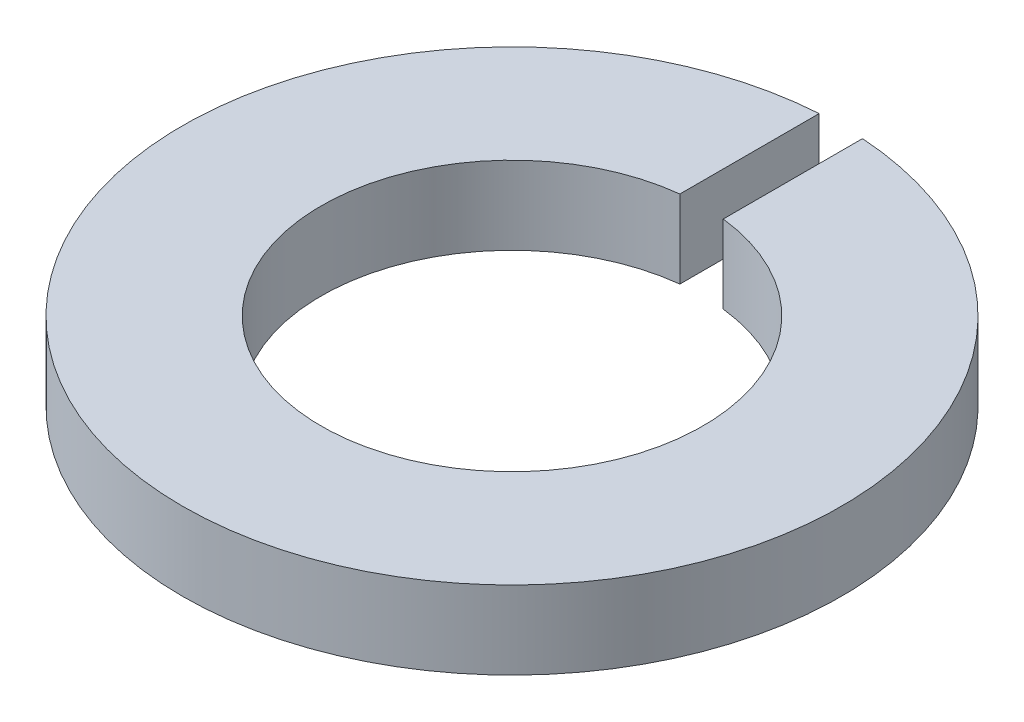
from build123d import *

# Parameters (mm, degrees)
SKETCH1_R          = 3.8
BASE_EXTRUDE_DEPTH = 0.9
SKETCH2_R          = 2.2
CUT_EXTRUDE1_DEPTH = 6.44885309
CUT_EXTRUDE2_REACH = 7.449
SKETCH3_W          = 0.5
SKETCH3_H          = 1.614250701


with BuildPart() as part:
    # Sketch1 → Base-Extrude (new body)
    with BuildSketch(Plane(origin=(0, 0, 0), x_dir=(1, 0, 0), z_dir=(0, 1, 0))):
        with Locations(Location((0, 0, 0), (0, 0, 270))):
            Circle(SKETCH1_R)
    extrude(amount=BASE_EXTRUDE_DEPTH)

    # Sketch2 → Cut-Extrude1 (cut, through all)
    with BuildSketch(Plane(origin=(0, 0.9, 0), x_dir=(-1, 0, 0), z_dir=(0, 1, 0))):
        with Locations(Location((0, 0, 0), (0, 0, 90))):
            Circle(SKETCH2_R)
    extrude(amount=-CUT_EXTRUDE1_DEPTH, mode=Mode.SUBTRACT)

    # Sketch3 → Cut-Extrude2 (cut, up to next)
    with BuildSketch(Plane(origin=(0, 0.9, 0), x_dir=(-1, 0, 0), z_dir=(0, 1, 0)), mode=Mode.PRIVATE) as cut_extrude2_sk1:
        with Locations((0, -2.99287465)):
            Rectangle(SKETCH3_W, SKETCH3_H)
    cut_extrude2_tool1 = extrude(cut_extrude2_sk1.sketch, amount=-CUT_EXTRUDE2_REACH, mode=Mode.PRIVATE) & part.part
    add(cut_extrude2_tool1.solids().sort_by_distance((0, 0.9, -2.992875))[0], mode=Mode.SUBTRACT)


solid = part.part
